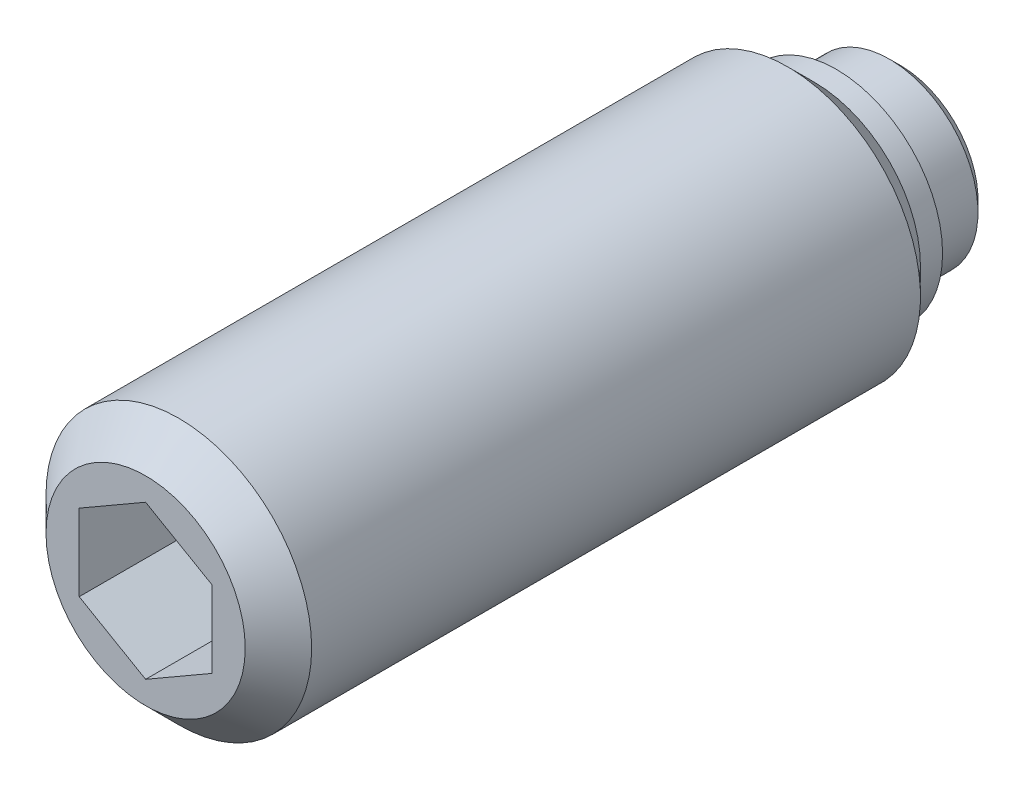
ISO-10303-21;
HEADER;
FILE_DESCRIPTION(('STEP AP214'),'2;1');
FILE_NAME('part.step','',(''),(''),'','','');
FILE_SCHEMA(('AUTOMOTIVE_DESIGN { 1 0 10303 214 1 1 1 1 }'));
ENDSEC;
DATA;
#1=APPLICATION_CONTEXT('core data for automotive mechanical design processes');
#2=APPLICATION_PROTOCOL_DEFINITION('international standard','automotive_design',2000,#1);
#3=PRODUCT_CONTEXT('',#1,'mechanical');
#4=PRODUCT('Part','Part','',(#3));
#5=PRODUCT_RELATED_PRODUCT_CATEGORY('part','',(#4));
#6=PRODUCT_DEFINITION_FORMATION('','',#4);
#7=PRODUCT_DEFINITION_CONTEXT('part definition',#1,'design');
#8=PRODUCT_DEFINITION('design','',#6,#7);
#9=PRODUCT_DEFINITION_SHAPE('','',#8);
#10=(LENGTH_UNIT() NAMED_UNIT(*) SI_UNIT(.MILLI.,.METRE.));
#11=(NAMED_UNIT(*) PLANE_ANGLE_UNIT() SI_UNIT($,.RADIAN.));
#12=(NAMED_UNIT(*) SI_UNIT($,.STERADIAN.) SOLID_ANGLE_UNIT());
#13=UNCERTAINTY_MEASURE_WITH_UNIT(LENGTH_MEASURE(1.E-05),#10,'distance_accuracy_value','');
#14=(GEOMETRIC_REPRESENTATION_CONTEXT(3) GLOBAL_UNCERTAINTY_ASSIGNED_CONTEXT((#13)) GLOBAL_UNIT_ASSIGNED_CONTEXT((#10,
#11,#12)) REPRESENTATION_CONTEXT('',''));
#15=CARTESIAN_POINT('',(0.,0.,0.));
#16=DIRECTION('',(0.,0.,1.));
#17=DIRECTION('',(1.,0.,0.));
#18=AXIS2_PLACEMENT_3D('',#15,#16,#17);
#19=CARTESIAN_POINT('',(0.,0.,0.));
#20=DIRECTION('',(0.,0.,-1.));
#21=DIRECTION('',(-1.,0.,0.));
#22=AXIS2_PLACEMENT_3D('',#19,#20,#21);
#23=CYLINDRICAL_SURFACE('',#22,4.);
#24=CARTESIAN_POINT('',(0.,0.,0.5));
#25=DIRECTION('',(0.,0.,-1.));
#26=DIRECTION('',(-1.,0.,0.));
#27=AXIS2_PLACEMENT_3D('',#24,#25,#26);
#28=CIRCLE('',#27,4.);
#29=CARTESIAN_POINT('',(-4.,0.,0.5));
#30=VERTEX_POINT('',#29);
#31=EDGE_CURVE('E133',#30,#30,#28,.T.);
#32=ORIENTED_EDGE('',*,*,#31,.F.);
#33=EDGE_LOOP('',(#32));
#34=FACE_BOUND('',#33,.T.);
#35=CARTESIAN_POINT('',(0.,0.,2.9));
#36=DIRECTION('',(0.,0.,-1.));
#37=DIRECTION('',(-1.,0.,0.));
#38=AXIS2_PLACEMENT_3D('',#35,#36,#37);
#39=CIRCLE('',#38,4.);
#40=CARTESIAN_POINT('',(-4.,0.,2.9));
#41=VERTEX_POINT('',#40);
#42=EDGE_CURVE('E127',#41,#41,#39,.T.);
#43=ORIENTED_EDGE('',*,*,#42,.T.);
#44=EDGE_LOOP('',(#43));
#45=FACE_BOUND('',#44,.T.);
#46=ADVANCED_FACE('F14',(#34,#45),#23,.T.);
#47=CARTESIAN_POINT('',(0.,0.,0.5));
#48=DIRECTION('',(0.,0.,1.));
#49=DIRECTION('',(1.,0.,0.));
#50=AXIS2_PLACEMENT_3D('',#47,#48,#49);
#51=CONICAL_SURFACE('',#50,4.,0.785398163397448);
#52=CARTESIAN_POINT('',(0.,0.,0.));
#53=DIRECTION('',(0.,0.,-1.));
#54=DIRECTION('',(-1.,0.,0.));
#55=AXIS2_PLACEMENT_3D('',#52,#53,#54);
#56=CIRCLE('',#55,3.5);
#57=CARTESIAN_POINT('',(-3.5,0.,0.));
#58=VERTEX_POINT('',#57);
#59=EDGE_CURVE('E130',#58,#58,#56,.T.);
#60=ORIENTED_EDGE('',*,*,#59,.F.);
#61=EDGE_LOOP('',(#60));
#62=FACE_BOUND('',#61,.T.);
#63=ORIENTED_EDGE('',*,*,#31,.T.);
#64=EDGE_LOOP('',(#63));
#65=FACE_BOUND('',#64,.T.);
#66=ADVANCED_FACE('F159',(#62,#65),#51,.T.);
#67=CARTESIAN_POINT('',(0.,3.5,0.));
#68=DIRECTION('',(0.,0.,1.));
#69=DIRECTION('',(1.,0.,0.));
#70=AXIS2_PLACEMENT_3D('',#67,#68,#69);
#71=PLANE('',#70);
#72=ORIENTED_EDGE('',*,*,#59,.T.);
#73=EDGE_LOOP('',(#72));
#74=FACE_BOUND('',#73,.T.);
#75=ADVANCED_FACE('F165',(#74),#71,.F.);
#76=CARTESIAN_POINT('',(0.,0.,2.9));
#77=DIRECTION('',(0.,0.,-1.));
#78=DIRECTION('',(-1.,0.,0.));
#79=AXIS2_PLACEMENT_3D('',#76,#77,#78);
#80=CYLINDRICAL_SURFACE('',#79,6.);
#81=CARTESIAN_POINT('',(0.,0.,5.1));
#82=DIRECTION('',(0.,0.,-1.));
#83=DIRECTION('',(-1.,0.,0.));
#84=AXIS2_PLACEMENT_3D('',#81,#82,#83);
#85=CIRCLE('',#84,6.);
#86=CARTESIAN_POINT('',(-6.,0.,5.1));
#87=VERTEX_POINT('',#86);
#88=EDGE_CURVE('E9',#87,#87,#85,.T.);
#89=ORIENTED_EDGE('',*,*,#88,.F.);
#90=EDGE_LOOP('',(#89));
#91=FACE_BOUND('',#90,.T.);
#92=CARTESIAN_POINT('',(0.,0.,32.6));
#93=DIRECTION('',(0.,0.,1.));
#94=DIRECTION('',(1.,0.,0.));
#95=AXIS2_PLACEMENT_3D('',#92,#93,#94);
#96=CIRCLE('',#95,6.);
#97=CARTESIAN_POINT('',(6.,0.,32.6));
#98=VERTEX_POINT('',#97);
#99=EDGE_CURVE('E124',#98,#98,#96,.T.);
#100=ORIENTED_EDGE('',*,*,#99,.F.);
#101=EDGE_LOOP('',(#100));
#102=FACE_BOUND('',#101,.T.);
#103=ADVANCED_FACE('F16',(#91,#102),#80,.T.);
#104=CARTESIAN_POINT('',(0.,4.8,2.9));
#105=DIRECTION('',(0.,0.,1.));
#106=DIRECTION('',(1.,0.,0.));
#107=AXIS2_PLACEMENT_3D('',#104,#105,#106);
#108=PLANE('',#107);
#109=CARTESIAN_POINT('',(0.,0.,2.9));
#110=DIRECTION('',(0.,0.,-1.));
#111=DIRECTION('',(-1.,0.,0.));
#112=AXIS2_PLACEMENT_3D('',#109,#110,#111);
#113=CIRCLE('',#112,4.8);
#114=CARTESIAN_POINT('',(-4.8,0.,2.9));
#115=VERTEX_POINT('',#114);
#116=EDGE_CURVE('E136',#115,#115,#113,.T.);
#117=ORIENTED_EDGE('',*,*,#116,.T.);
#118=EDGE_LOOP('',(#117));
#119=FACE_BOUND('',#118,.T.);
#120=ORIENTED_EDGE('',*,*,#42,.F.);
#121=EDGE_LOOP('',(#120));
#122=FACE_BOUND('',#121,.T.);
#123=ADVANCED_FACE('F156',(#119,#122),#108,.F.);
#124=CARTESIAN_POINT('',(0.,0.,2.9));
#125=DIRECTION('',(0.,0.,-1.));
#126=DIRECTION('',(-1.,0.,0.));
#127=AXIS2_PLACEMENT_3D('',#124,#125,#126);
#128=CYLINDRICAL_SURFACE('',#127,4.8);
#129=CARTESIAN_POINT('',(0.,0.,3.9));
#130=DIRECTION('',(0.,0.,-1.));
#131=DIRECTION('',(-1.,0.,0.));
#132=AXIS2_PLACEMENT_3D('',#129,#130,#131);
#133=CIRCLE('',#132,4.8);
#134=CARTESIAN_POINT('',(-4.8,0.,3.9));
#135=VERTEX_POINT('',#134);
#136=EDGE_CURVE('E22',#135,#135,#133,.T.);
#137=ORIENTED_EDGE('',*,*,#136,.T.);
#138=EDGE_LOOP('',(#137));
#139=FACE_BOUND('',#138,.T.);
#140=ORIENTED_EDGE('',*,*,#116,.F.);
#141=EDGE_LOOP('',(#140));
#142=FACE_BOUND('',#141,.T.);
#143=ADVANCED_FACE('F141',(#139,#142),#128,.T.);
#144=CARTESIAN_POINT('',(0.,0.,5.1));
#145=DIRECTION('',(0.,0.,1.));
#146=DIRECTION('',(1.,0.,0.));
#147=AXIS2_PLACEMENT_3D('',#144,#145,#146);
#148=CONICAL_SURFACE('',#147,6.,0.785398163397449);
#149=ORIENTED_EDGE('',*,*,#88,.T.);
#150=EDGE_LOOP('',(#149));
#151=FACE_BOUND('',#150,.T.);
#152=ORIENTED_EDGE('',*,*,#136,.F.);
#153=EDGE_LOOP('',(#152));
#154=FACE_BOUND('',#153,.T.);
#155=ADVANCED_FACE('F144',(#151,#154),#148,.T.);
#156=CARTESIAN_POINT('',(0.,-4.5,34.1));
#157=DIRECTION('',(0.,0.,1.));
#158=DIRECTION('',(1.,0.,0.));
#159=AXIS2_PLACEMENT_3D('',#156,#157,#158);
#160=PLANE('',#159);
#161=DIRECTION('',(0.866025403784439,-0.5,0.));
#162=VECTOR('',#161,1.);
#163=CARTESIAN_POINT('',(-3.,-1.73205080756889,34.1));
#164=LINE('',#163,#162);
#165=CARTESIAN_POINT('',(-3.,-1.73205080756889,34.1));
#166=VERTEX_POINT('',#165);
#167=CARTESIAN_POINT('',(0.,-3.46410161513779,34.1));
#168=VERTEX_POINT('',#167);
#169=EDGE_CURVE('E29',#166,#168,#164,.T.);
#170=ORIENTED_EDGE('',*,*,#169,.F.);
#171=DIRECTION('',(0.,-1.,0.));
#172=VECTOR('',#171,1.);
#173=CARTESIAN_POINT('',(-3.,1.73205080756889,34.1));
#174=LINE('',#173,#172);
#175=CARTESIAN_POINT('',(-3.,1.73205080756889,34.1));
#176=VERTEX_POINT('',#175);
#177=EDGE_CURVE('E112',#176,#166,#174,.T.);
#178=ORIENTED_EDGE('',*,*,#177,.F.);
#179=DIRECTION('',(-0.866025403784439,-0.5,0.));
#180=VECTOR('',#179,1.);
#181=CARTESIAN_POINT('',(0.,3.46410161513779,34.1));
#182=LINE('',#181,#180);
#183=CARTESIAN_POINT('',(0.,3.46410161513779,34.1));
#184=VERTEX_POINT('',#183);
#185=EDGE_CURVE('E110',#184,#176,#182,.T.);
#186=ORIENTED_EDGE('',*,*,#185,.F.);
#187=DIRECTION('',(-0.866025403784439,0.5,0.));
#188=VECTOR('',#187,1.);
#189=CARTESIAN_POINT('',(3.,1.73205080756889,34.1));
#190=LINE('',#189,#188);
#191=CARTESIAN_POINT('',(3.,1.73205080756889,34.1));
#192=VERTEX_POINT('',#191);
#193=EDGE_CURVE('E77',#192,#184,#190,.T.);
#194=ORIENTED_EDGE('',*,*,#193,.F.);
#195=DIRECTION('',(0.,1.,0.));
#196=VECTOR('',#195,1.);
#197=CARTESIAN_POINT('',(3.,-1.73205080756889,34.1));
#198=LINE('',#197,#196);
#199=CARTESIAN_POINT('',(3.,-1.73205080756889,34.1));
#200=VERTEX_POINT('',#199);
#201=EDGE_CURVE('E106',#200,#192,#198,.T.);
#202=ORIENTED_EDGE('',*,*,#201,.F.);
#203=DIRECTION('',(0.866025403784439,0.5,0.));
#204=VECTOR('',#203,1.);
#205=CARTESIAN_POINT('',(0.,-3.46410161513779,34.1));
#206=LINE('',#205,#204);
#207=EDGE_CURVE('E103',#168,#200,#206,.T.);
#208=ORIENTED_EDGE('',*,*,#207,.F.);
#209=EDGE_LOOP('',(#170,#178,#186,#194,#202,#208));
#210=FACE_BOUND('',#209,.T.);
#211=CARTESIAN_POINT('',(0.,0.,34.1));
#212=DIRECTION('',(0.,0.,1.));
#213=DIRECTION('',(1.,0.,0.));
#214=AXIS2_PLACEMENT_3D('',#211,#212,#213);
#215=CIRCLE('',#214,4.5);
#216=CARTESIAN_POINT('',(4.5,0.,34.1));
#217=VERTEX_POINT('',#216);
#218=EDGE_CURVE('E116',#217,#217,#215,.T.);
#219=ORIENTED_EDGE('',*,*,#218,.T.);
#220=EDGE_LOOP('',(#219));
#221=FACE_BOUND('',#220,.T.);
#222=ADVANCED_FACE('F146',(#210,#221),#160,.T.);
#223=CARTESIAN_POINT('',(0.,0.,34.1));
#224=DIRECTION('',(0.,0.,-1.));
#225=DIRECTION('',(-1.,0.,0.));
#226=AXIS2_PLACEMENT_3D('',#223,#224,#225);
#227=CONICAL_SURFACE('',#226,4.5,0.785398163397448);
#228=ORIENTED_EDGE('',*,*,#99,.T.);
#229=EDGE_LOOP('',(#228));
#230=FACE_BOUND('',#229,.T.);
#231=ORIENTED_EDGE('',*,*,#218,.F.);
#232=EDGE_LOOP('',(#231));
#233=FACE_BOUND('',#232,.T.);
#234=ADVANCED_FACE('F153',(#230,#233),#227,.T.);
#235=CARTESIAN_POINT('',(-3.,-1.73205080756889,26.1));
#236=DIRECTION('',(-0.5,-0.866025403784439,0.));
#237=DIRECTION('',(0.866025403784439,-0.5,0.));
#238=AXIS2_PLACEMENT_3D('',#235,#236,#237);
#239=PLANE('',#238);
#240=ORIENTED_EDGE('',*,*,#169,.T.);
#241=DIRECTION('',(0.,0.,1.));
#242=VECTOR('',#241,1.);
#243=CARTESIAN_POINT('',(0.,-3.46410161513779,26.1));
#244=LINE('',#243,#242);
#245=CARTESIAN_POINT('',(0.,-3.46410161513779,26.1));
#246=VERTEX_POINT('',#245);
#247=EDGE_CURVE('E59',#246,#168,#244,.T.);
#248=ORIENTED_EDGE('',*,*,#247,.F.);
#249=DIRECTION('',(0.866025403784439,-0.5,0.));
#250=VECTOR('',#249,1.);
#251=CARTESIAN_POINT('',(-3.,-1.73205080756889,26.1));
#252=LINE('',#251,#250);
#253=CARTESIAN_POINT('',(-3.,-1.73205080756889,26.1));
#254=VERTEX_POINT('',#253);
#255=EDGE_CURVE('E114',#254,#246,#252,.T.);
#256=ORIENTED_EDGE('',*,*,#255,.F.);
#257=DIRECTION('',(0.,0.,1.));
#258=VECTOR('',#257,1.);
#259=CARTESIAN_POINT('',(-3.,-1.73205080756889,26.1));
#260=LINE('',#259,#258);
#261=EDGE_CURVE('E37',#254,#166,#260,.T.);
#262=ORIENTED_EDGE('',*,*,#261,.T.);
#263=EDGE_LOOP('',(#240,#248,#256,#262));
#264=FACE_BOUND('',#263,.T.);
#265=ADVANCED_FACE('F191',(#264),#239,.F.);
#266=CARTESIAN_POINT('',(-3.,1.73205080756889,26.1));
#267=DIRECTION('',(-1.,0.,0.));
#268=DIRECTION('',(0.,0.,1.));
#269=AXIS2_PLACEMENT_3D('',#266,#267,#268);
#270=PLANE('',#269);
#271=ORIENTED_EDGE('',*,*,#177,.T.);
#272=ORIENTED_EDGE('',*,*,#261,.F.);
#273=DIRECTION('',(0.,-1.,0.));
#274=VECTOR('',#273,1.);
#275=CARTESIAN_POINT('',(-3.,1.73205080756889,26.1));
#276=LINE('',#275,#274);
#277=CARTESIAN_POINT('',(-3.,1.73205080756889,26.1));
#278=VERTEX_POINT('',#277);
#279=EDGE_CURVE('E89',#278,#254,#276,.T.);
#280=ORIENTED_EDGE('',*,*,#279,.F.);
#281=DIRECTION('',(0.,0.,1.));
#282=VECTOR('',#281,1.);
#283=CARTESIAN_POINT('',(-3.,1.73205080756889,26.1));
#284=LINE('',#283,#282);
#285=EDGE_CURVE('E81',#278,#176,#284,.T.);
#286=ORIENTED_EDGE('',*,*,#285,.T.);
#287=EDGE_LOOP('',(#271,#272,#280,#286));
#288=FACE_BOUND('',#287,.T.);
#289=ADVANCED_FACE('F198',(#288),#270,.F.);
#290=CARTESIAN_POINT('',(0.,3.46410161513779,26.1));
#291=DIRECTION('',(-0.5,0.866025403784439,0.));
#292=DIRECTION('',(-0.866025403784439,-0.5,0.));
#293=AXIS2_PLACEMENT_3D('',#290,#291,#292);
#294=PLANE('',#293);
#295=ORIENTED_EDGE('',*,*,#185,.T.);
#296=ORIENTED_EDGE('',*,*,#285,.F.);
#297=DIRECTION('',(-0.866025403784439,-0.5,0.));
#298=VECTOR('',#297,1.);
#299=CARTESIAN_POINT('',(0.,3.46410161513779,26.1));
#300=LINE('',#299,#298);
#301=CARTESIAN_POINT('',(0.,3.46410161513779,26.1));
#302=VERTEX_POINT('',#301);
#303=EDGE_CURVE('E85',#302,#278,#300,.T.);
#304=ORIENTED_EDGE('',*,*,#303,.F.);
#305=DIRECTION('',(0.,0.,1.));
#306=VECTOR('',#305,1.);
#307=CARTESIAN_POINT('',(0.,3.46410161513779,26.1));
#308=LINE('',#307,#306);
#309=EDGE_CURVE('E70',#302,#184,#308,.T.);
#310=ORIENTED_EDGE('',*,*,#309,.T.);
#311=EDGE_LOOP('',(#295,#296,#304,#310));
#312=FACE_BOUND('',#311,.T.);
#313=ADVANCED_FACE('F86',(#312),#294,.F.);
#314=CARTESIAN_POINT('',(3.,1.73205080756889,26.1));
#315=DIRECTION('',(0.5,0.866025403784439,0.));
#316=DIRECTION('',(-0.866025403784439,0.5,0.));
#317=AXIS2_PLACEMENT_3D('',#314,#315,#316);
#318=PLANE('',#317);
#319=ORIENTED_EDGE('',*,*,#193,.T.);
#320=ORIENTED_EDGE('',*,*,#309,.F.);
#321=DIRECTION('',(-0.866025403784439,0.5,0.));
#322=VECTOR('',#321,1.);
#323=CARTESIAN_POINT('',(3.,1.73205080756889,26.1));
#324=LINE('',#323,#322);
#325=CARTESIAN_POINT('',(3.,1.73205080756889,26.1));
#326=VERTEX_POINT('',#325);
#327=EDGE_CURVE('E74',#326,#302,#324,.T.);
#328=ORIENTED_EDGE('',*,*,#327,.F.);
#329=DIRECTION('',(0.,0.,1.));
#330=VECTOR('',#329,1.);
#331=CARTESIAN_POINT('',(3.,1.73205080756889,26.1));
#332=LINE('',#331,#330);
#333=EDGE_CURVE('E82',#326,#192,#332,.T.);
#334=ORIENTED_EDGE('',*,*,#333,.T.);
#335=EDGE_LOOP('',(#319,#320,#328,#334));
#336=FACE_BOUND('',#335,.T.);
#337=ADVANCED_FACE('F72',(#336),#318,.F.);
#338=CARTESIAN_POINT('',(3.,-1.73205080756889,26.1));
#339=DIRECTION('',(1.,0.,0.));
#340=DIRECTION('',(0.,0.,-1.));
#341=AXIS2_PLACEMENT_3D('',#338,#339,#340);
#342=PLANE('',#341);
#343=ORIENTED_EDGE('',*,*,#201,.T.);
#344=ORIENTED_EDGE('',*,*,#333,.F.);
#345=DIRECTION('',(0.,1.,0.));
#346=VECTOR('',#345,1.);
#347=CARTESIAN_POINT('',(3.,-1.73205080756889,26.1));
#348=LINE('',#347,#346);
#349=CARTESIAN_POINT('',(3.,-1.73205080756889,26.1));
#350=VERTEX_POINT('',#349);
#351=EDGE_CURVE('E95',#350,#326,#348,.T.);
#352=ORIENTED_EDGE('',*,*,#351,.F.);
#353=DIRECTION('',(0.,0.,1.));
#354=VECTOR('',#353,1.);
#355=CARTESIAN_POINT('',(3.,-1.73205080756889,26.1));
#356=LINE('',#355,#354);
#357=EDGE_CURVE('E119',#350,#200,#356,.T.);
#358=ORIENTED_EDGE('',*,*,#357,.T.);
#359=EDGE_LOOP('',(#343,#344,#352,#358));
#360=FACE_BOUND('',#359,.T.);
#361=ADVANCED_FACE('F204',(#360),#342,.F.);
#362=CARTESIAN_POINT('',(0.,-3.46410161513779,26.1));
#363=DIRECTION('',(0.5,-0.866025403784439,0.));
#364=DIRECTION('',(0.866025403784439,0.5,0.));
#365=AXIS2_PLACEMENT_3D('',#362,#363,#364);
#366=PLANE('',#365);
#367=ORIENTED_EDGE('',*,*,#207,.T.);
#368=ORIENTED_EDGE('',*,*,#357,.F.);
#369=DIRECTION('',(0.866025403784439,0.5,0.));
#370=VECTOR('',#369,1.);
#371=CARTESIAN_POINT('',(0.,-3.46410161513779,26.1));
#372=LINE('',#371,#370);
#373=EDGE_CURVE('E97',#246,#350,#372,.T.);
#374=ORIENTED_EDGE('',*,*,#373,.F.);
#375=ORIENTED_EDGE('',*,*,#247,.T.);
#376=EDGE_LOOP('',(#367,#368,#374,#375));
#377=FACE_BOUND('',#376,.T.);
#378=ADVANCED_FACE('F201',(#377),#366,.F.);
#379=CARTESIAN_POINT('',(0.,0.,26.1));
#380=DIRECTION('',(0.,0.,1.));
#381=DIRECTION('',(1.,0.,0.));
#382=AXIS2_PLACEMENT_3D('',#379,#380,#381);
#383=PLANE('',#382);
#384=ORIENTED_EDGE('',*,*,#255,.T.);
#385=ORIENTED_EDGE('',*,*,#373,.T.);
#386=ORIENTED_EDGE('',*,*,#351,.T.);
#387=ORIENTED_EDGE('',*,*,#327,.T.);
#388=ORIENTED_EDGE('',*,*,#303,.T.);
#389=ORIENTED_EDGE('',*,*,#279,.T.);
#390=EDGE_LOOP('',(#384,#385,#386,#387,#388,#389));
#391=FACE_BOUND('',#390,.T.);
#392=ADVANCED_FACE('F92',(#391),#383,.T.);
#393=CLOSED_SHELL('',(#46,#66,#75,#103,#123,#143,#155,#222,#234,#265,#289,#313,#337,#361,#378,#392));
#394=MANIFOLD_SOLID_BREP('B1',#393);
#395=ADVANCED_BREP_SHAPE_REPRESENTATION('',(#18,#394),#14);
#396=SHAPE_DEFINITION_REPRESENTATION(#9,#395);
ENDSEC;
END-ISO-10303-21;
